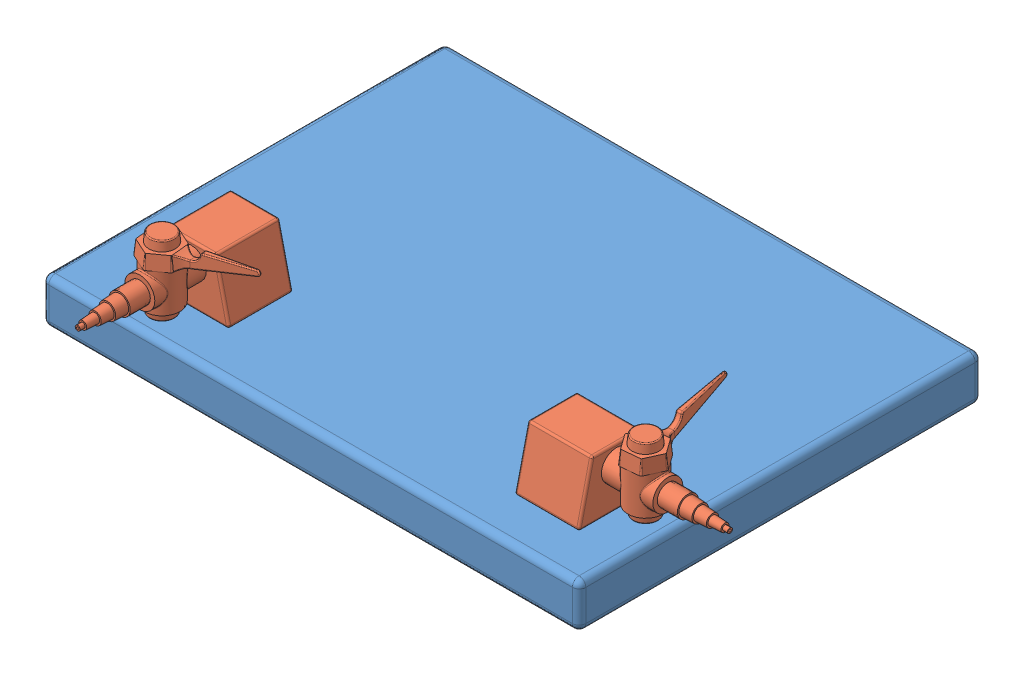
SolidWorks assembly ChemistryLab.SLDASM, configuration Default (file format 3400). Lengths in mm.
Overall size (691.96 149.34 539.56).
3 component instances, 2 part files, 6 mates.
Components (placement in the parent):
- CounterTop-1: CounterTop.SLDPRT [Default] at origin size (609.6 50.8 457.2)
- Valve-1: Valve.SLDPRT [Default] at (-186.2868 95.3278 276.1059) size (144.06 98.54 206.06)
- Valve-2: Valve.SLDPRT [Default] at (352.3059 95.3278 135.4868) x (0 0 -1) z (1 0 0) size (144.06 98.54 206.06)
Mates (geometry in assembly coordinates):
- Distance1: distance = 50.8 mm aligned: plane of CounterTop-1 through (-304.8 50.8 228.6) normal (0 0 1); plane of Valve-1 through (-160.6551 114.3778 177.8) normal (0 0 1)
- Coincident2: coincident anti-aligned: plane of CounterTop-1 through (-304.8 50.8 228.6) normal (0 1 0); plane of Valve-1 through (-146.4474 50.8 104.902) normal (0 -1 0)
- Distance2: distance = 76.2 mm: plane of CounterTop-1 through (-304.8 50.8 -228.6) normal (-1 0 0); line of Valve-1
- Coincident4: coincident anti-aligned: plane of CounterTop-1 through (-304.8 50.8 228.6) normal (0 1 0); plane of Valve-2 through (181.102 50.8 95.6474) normal (0 -1 0)
- Distance3: distance = 50.8 mm aligned: plane of CounterTop-1 through (304.8 50.8 -228.6) normal (1 0 0); plane of Valve-2 through (254 114.3778 109.8551) normal (1 0 0)
- Distance4: distance = 50.8 mm: plane of CounterTop-1 through (-304.8 50.8 228.6) normal (0 0 1); line of Valve-2
